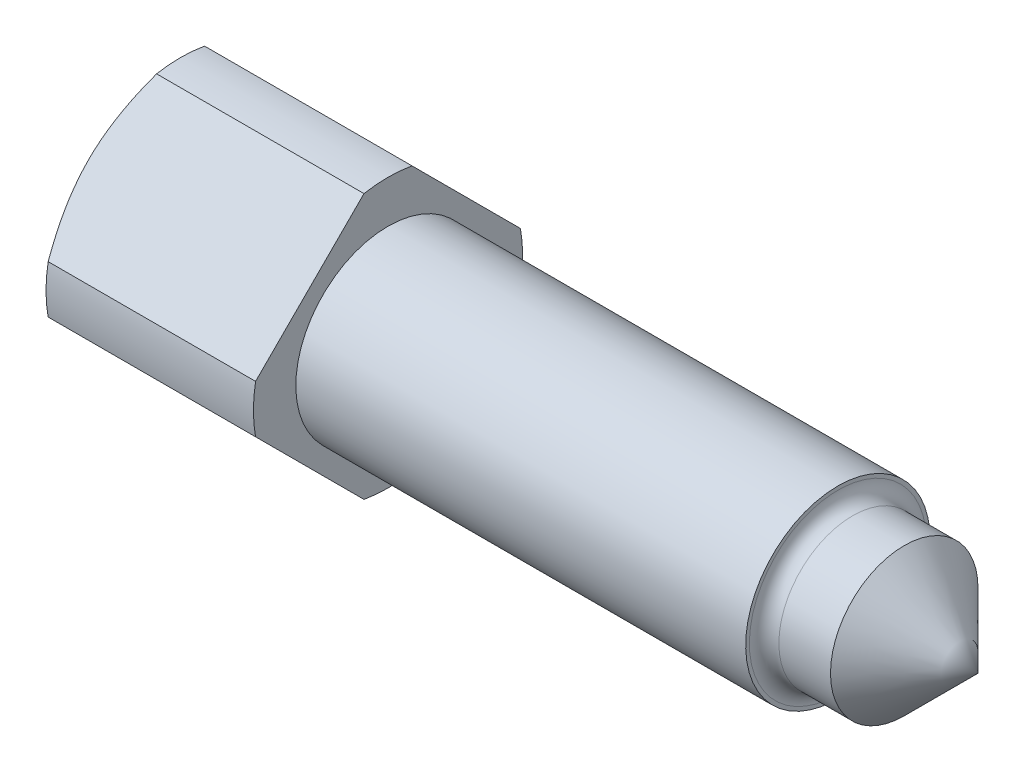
ISO-10303-21;
HEADER;
FILE_DESCRIPTION(('STEP AP214'),'2;1');
FILE_NAME('part.step','',(''),(''),'','','');
FILE_SCHEMA(('AUTOMOTIVE_DESIGN { 1 0 10303 214 1 1 1 1 }'));
ENDSEC;
DATA;
#1=APPLICATION_CONTEXT('core data for automotive mechanical design processes');
#2=APPLICATION_PROTOCOL_DEFINITION('international standard','automotive_design',2000,#1);
#3=PRODUCT_CONTEXT('',#1,'mechanical');
#4=PRODUCT('Part','Part','',(#3));
#5=PRODUCT_RELATED_PRODUCT_CATEGORY('part','',(#4));
#6=PRODUCT_DEFINITION_FORMATION('','',#4);
#7=PRODUCT_DEFINITION_CONTEXT('part definition',#1,'design');
#8=PRODUCT_DEFINITION('design','',#6,#7);
#9=PRODUCT_DEFINITION_SHAPE('','',#8);
#10=(LENGTH_UNIT() NAMED_UNIT(*) SI_UNIT(.MILLI.,.METRE.));
#11=(NAMED_UNIT(*) PLANE_ANGLE_UNIT() SI_UNIT($,.RADIAN.));
#12=(NAMED_UNIT(*) SI_UNIT($,.STERADIAN.) SOLID_ANGLE_UNIT());
#13=UNCERTAINTY_MEASURE_WITH_UNIT(LENGTH_MEASURE(1.E-05),#10,'distance_accuracy_value','');
#14=(GEOMETRIC_REPRESENTATION_CONTEXT(3) GLOBAL_UNCERTAINTY_ASSIGNED_CONTEXT((#13)) GLOBAL_UNIT_ASSIGNED_CONTEXT((#10,
#11,#12)) REPRESENTATION_CONTEXT('',''));
#15=CARTESIAN_POINT('',(0.,0.,0.));
#16=DIRECTION('',(0.,0.,1.));
#17=DIRECTION('',(1.,0.,0.));
#18=AXIS2_PLACEMENT_3D('',#15,#16,#17);
#19=CARTESIAN_POINT('',(6.,0.,0.));
#20=DIRECTION('',(1.,0.,0.));
#21=DIRECTION('',(0.,0.,-1.));
#22=AXIS2_PLACEMENT_3D('',#19,#20,#21);
#23=PLANE('',#22);
#24=CARTESIAN_POINT('',(6.,0.,0.));
#25=DIRECTION('',(1.,0.,0.));
#26=DIRECTION('',(0.,0.,-1.));
#27=AXIS2_PLACEMENT_3D('',#24,#25,#26);
#28=CIRCLE('',#27,3.65);
#29=CARTESIAN_POINT('',(6.00000000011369,0.651201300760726,3.59143938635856));
#30=VERTEX_POINT('',#29);
#31=CARTESIAN_POINT('',(6.00000000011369,-0.651201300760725,3.59143938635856));
#32=VERTEX_POINT('',#31);
#33=EDGE_CURVE('E265',#30,#32,#28,.T.);
#34=ORIENTED_EDGE('',*,*,#33,.T.);
#35=DIRECTION('',(0.,0.707106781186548,0.707106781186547));
#36=VECTOR('',#35,1.);
#37=CARTESIAN_POINT('',(6.00000000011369,-4.24264068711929,0.));
#38=LINE('',#37,#36);
#39=CARTESIAN_POINT('',(6.00000000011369,-3.59143938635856,0.651201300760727));
#40=VERTEX_POINT('',#39);
#41=EDGE_CURVE('E271',#40,#32,#38,.T.);
#42=ORIENTED_EDGE('',*,*,#41,.F.);
#43=CARTESIAN_POINT('',(6.00000000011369,-3.59143938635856,-0.651201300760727));
#44=VERTEX_POINT('',#43);
#45=EDGE_CURVE('E261',#40,#44,#28,.T.);
#46=ORIENTED_EDGE('',*,*,#45,.T.);
#47=DIRECTION('',(0.,-0.707106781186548,0.707106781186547));
#48=VECTOR('',#47,1.);
#49=CARTESIAN_POINT('',(6.00000000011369,0.,-4.24264068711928));
#50=LINE('',#49,#48);
#51=CARTESIAN_POINT('',(6.00000000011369,-0.651201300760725,-3.59143938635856));
#52=VERTEX_POINT('',#51);
#53=EDGE_CURVE('E283',#52,#44,#50,.T.);
#54=ORIENTED_EDGE('',*,*,#53,.F.);
#55=CARTESIAN_POINT('',(6.00000000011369,0.651201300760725,-3.59143938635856));
#56=VERTEX_POINT('',#55);
#57=EDGE_CURVE('E259',#52,#56,#28,.T.);
#58=ORIENTED_EDGE('',*,*,#57,.T.);
#59=DIRECTION('',(0.,-0.707106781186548,-0.707106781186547));
#60=VECTOR('',#59,1.);
#61=CARTESIAN_POINT('',(6.00000000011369,4.24264068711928,0.));
#62=LINE('',#61,#60);
#63=CARTESIAN_POINT('',(6.00000000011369,3.59143938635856,-0.651201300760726));
#64=VERTEX_POINT('',#63);
#65=EDGE_CURVE('E278',#64,#56,#62,.T.);
#66=ORIENTED_EDGE('',*,*,#65,.F.);
#67=CARTESIAN_POINT('',(6.00000000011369,3.59143938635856,0.651201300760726));
#68=VERTEX_POINT('',#67);
#69=EDGE_CURVE('E238',#64,#68,#28,.T.);
#70=ORIENTED_EDGE('',*,*,#69,.T.);
#71=DIRECTION('',(0.,0.707106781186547,-0.707106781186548));
#72=VECTOR('',#71,1.);
#73=CARTESIAN_POINT('',(6.00000000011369,0.,4.24264068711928));
#74=LINE('',#73,#72);
#75=EDGE_CURVE('E273',#30,#68,#74,.T.);
#76=ORIENTED_EDGE('',*,*,#75,.F.);
#77=EDGE_LOOP('',(#34,#42,#46,#54,#58,#66,#70,#76));
#78=FACE_BOUND('',#77,.T.);
#79=CARTESIAN_POINT('',(6.00000000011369,0.,0.));
#80=DIRECTION('',(1.,0.,0.));
#81=DIRECTION('',(0.,1.,0.));
#82=AXIS2_PLACEMENT_3D('',#79,#80,#81);
#83=CIRCLE('',#82,2.5);
#84=CARTESIAN_POINT('',(6.00000000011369,2.5,0.));
#85=VERTEX_POINT('',#84);
#86=EDGE_CURVE('E130',#85,#85,#83,.T.);
#87=ORIENTED_EDGE('',*,*,#86,.F.);
#88=EDGE_LOOP('',(#87));
#89=FACE_BOUND('',#88,.T.);
#90=ADVANCED_FACE('F38',(#78,#89),#23,.T.);
#91=CARTESIAN_POINT('',(6.,0.,0.));
#92=DIRECTION('',(-1.,0.,0.));
#93=DIRECTION('',(0.,0.,1.));
#94=AXIS2_PLACEMENT_3D('',#91,#92,#93);
#95=CYLINDRICAL_SURFACE('',#94,3.65);
#96=DIRECTION('',(-1.,0.,0.));
#97=VECTOR('',#96,1.);
#98=CARTESIAN_POINT('',(6.,0.651201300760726,3.59143938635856));
#99=LINE('',#98,#97);
#100=CARTESIAN_POINT('',(0.375277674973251,0.651201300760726,3.59143938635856));
#101=VERTEX_POINT('',#100);
#102=EDGE_CURVE('E247',#101,#30,#99,.F.);
#103=ORIENTED_EDGE('',*,*,#102,.F.);
#104=CARTESIAN_POINT('',(0.375277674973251,0.,0.));
#105=DIRECTION('',(1.,0.,0.));
#106=DIRECTION('',(0.,1.,0.));
#107=AXIS2_PLACEMENT_3D('',#104,#105,#106);
#108=CIRCLE('',#107,3.65);
#109=CARTESIAN_POINT('',(0.375277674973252,-0.651201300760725,3.59143938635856));
#110=VERTEX_POINT('',#109);
#111=EDGE_CURVE('E142',#101,#110,#108,.T.);
#112=ORIENTED_EDGE('',*,*,#111,.T.);
#113=DIRECTION('',(-1.,0.,0.));
#114=VECTOR('',#113,1.);
#115=CARTESIAN_POINT('',(6.,-0.651201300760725,3.59143938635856));
#116=LINE('',#115,#114);
#117=EDGE_CURVE('E257',#32,#110,#116,.T.);
#118=ORIENTED_EDGE('',*,*,#117,.F.);
#119=ORIENTED_EDGE('',*,*,#33,.F.);
#120=EDGE_LOOP('',(#103,#112,#118,#119));
#121=FACE_BOUND('',#120,.T.);
#122=ADVANCED_FACE('F211',(#121),#95,.T.);
#123=DIRECTION('',(-1.,0.,0.));
#124=VECTOR('',#123,1.);
#125=CARTESIAN_POINT('',(6.,-3.59143938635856,0.651201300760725));
#126=LINE('',#125,#124);
#127=CARTESIAN_POINT('',(0.375277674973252,-3.59143938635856,0.651201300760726));
#128=VERTEX_POINT('',#127);
#129=EDGE_CURVE('E255',#128,#40,#126,.F.);
#130=ORIENTED_EDGE('',*,*,#129,.F.);
#131=CARTESIAN_POINT('',(0.375277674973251,0.,0.));
#132=DIRECTION('',(1.,0.,0.));
#133=DIRECTION('',(0.,1.,0.));
#134=AXIS2_PLACEMENT_3D('',#131,#132,#133);
#135=CIRCLE('',#134,3.65);
#136=CARTESIAN_POINT('',(0.375277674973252,-3.59143938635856,-0.651201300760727));
#137=VERTEX_POINT('',#136);
#138=EDGE_CURVE('E138',#128,#137,#135,.T.);
#139=ORIENTED_EDGE('',*,*,#138,.T.);
#140=DIRECTION('',(-1.,0.,0.));
#141=VECTOR('',#140,1.);
#142=CARTESIAN_POINT('',(6.,-3.59143938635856,-0.651201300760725));
#143=LINE('',#142,#141);
#144=EDGE_CURVE('E252',#44,#137,#143,.T.);
#145=ORIENTED_EDGE('',*,*,#144,.F.);
#146=ORIENTED_EDGE('',*,*,#45,.F.);
#147=EDGE_LOOP('',(#130,#139,#145,#146));
#148=FACE_BOUND('',#147,.T.);
#149=ADVANCED_FACE('F217',(#148),#95,.T.);
#150=DIRECTION('',(-1.,0.,0.));
#151=VECTOR('',#150,1.);
#152=CARTESIAN_POINT('',(6.,-0.651201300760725,-3.59143938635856));
#153=LINE('',#152,#151);
#154=CARTESIAN_POINT('',(0.375277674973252,-0.651201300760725,-3.59143938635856));
#155=VERTEX_POINT('',#154);
#156=EDGE_CURVE('E245',#155,#52,#153,.F.);
#157=ORIENTED_EDGE('',*,*,#156,.F.);
#158=CARTESIAN_POINT('',(0.375277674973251,0.,0.));
#159=DIRECTION('',(1.,0.,0.));
#160=DIRECTION('',(0.,1.,0.));
#161=AXIS2_PLACEMENT_3D('',#158,#159,#160);
#162=CIRCLE('',#161,3.65);
#163=CARTESIAN_POINT('',(0.375277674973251,0.651201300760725,-3.59143938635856));
#164=VERTEX_POINT('',#163);
#165=EDGE_CURVE('E192',#155,#164,#162,.T.);
#166=ORIENTED_EDGE('',*,*,#165,.T.);
#167=DIRECTION('',(-1.,0.,0.));
#168=VECTOR('',#167,1.);
#169=CARTESIAN_POINT('',(6.,0.651201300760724,-3.59143938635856));
#170=LINE('',#169,#168);
#171=EDGE_CURVE('E241',#56,#164,#170,.T.);
#172=ORIENTED_EDGE('',*,*,#171,.F.);
#173=ORIENTED_EDGE('',*,*,#57,.F.);
#174=EDGE_LOOP('',(#157,#166,#172,#173));
#175=FACE_BOUND('',#174,.T.);
#176=ADVANCED_FACE('F222',(#175),#95,.T.);
#177=DIRECTION('',(-1.,0.,0.));
#178=VECTOR('',#177,1.);
#179=CARTESIAN_POINT('',(6.,3.59143938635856,-0.651201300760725));
#180=LINE('',#179,#178);
#181=CARTESIAN_POINT('',(0.375277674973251,3.59143938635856,-0.651201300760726));
#182=VERTEX_POINT('',#181);
#183=EDGE_CURVE('E234',#182,#64,#180,.F.);
#184=ORIENTED_EDGE('',*,*,#183,.F.);
#185=CARTESIAN_POINT('',(0.375277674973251,0.,0.));
#186=DIRECTION('',(1.,0.,0.));
#187=DIRECTION('',(0.,1.,0.));
#188=AXIS2_PLACEMENT_3D('',#185,#186,#187);
#189=CIRCLE('',#188,3.65);
#190=CARTESIAN_POINT('',(0.37527767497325,3.59143938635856,0.651201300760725));
#191=VERTEX_POINT('',#190);
#192=EDGE_CURVE('E193',#182,#191,#189,.T.);
#193=ORIENTED_EDGE('',*,*,#192,.T.);
#194=DIRECTION('',(-1.,0.,0.));
#195=VECTOR('',#194,1.);
#196=CARTESIAN_POINT('',(6.,3.59143938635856,0.651201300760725));
#197=LINE('',#196,#195);
#198=EDGE_CURVE('E242',#68,#191,#197,.T.);
#199=ORIENTED_EDGE('',*,*,#198,.F.);
#200=ORIENTED_EDGE('',*,*,#69,.F.);
#201=EDGE_LOOP('',(#184,#193,#199,#200));
#202=FACE_BOUND('',#201,.T.);
#203=ADVANCED_FACE('F202',(#202),#95,.T.);
#204=CARTESIAN_POINT('',(6.00000000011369,0.,4.24264068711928));
#205=DIRECTION('',(0.,0.707106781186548,0.707106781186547));
#206=DIRECTION('',(0.,-0.707106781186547,0.707106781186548));
#207=AXIS2_PLACEMENT_3D('',#204,#205,#206);
#208=PLANE('',#207);
#209=CARTESIAN_POINT('',(0.375370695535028,0.651001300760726,3.59163938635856));
#210=CARTESIAN_POINT('',(0.323268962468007,0.763120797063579,3.47951989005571));
#211=CARTESIAN_POINT('',(0.274661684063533,0.876174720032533,3.36646596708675));
#212=CARTESIAN_POINT('',(0.18690962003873,1.10452820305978,3.13811248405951));
#213=CARTESIAN_POINT('',(0.14779994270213,1.21983444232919,3.0228062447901));
#214=CARTESIAN_POINT('',(0.0829033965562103,1.44883414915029,2.79380653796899));
#215=CARTESIAN_POINT('',(0.0567585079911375,1.56247530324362,2.68016538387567));
#216=CARTESIAN_POINT('',(0.0185374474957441,1.79078192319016,2.45185876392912));
#217=CARTESIAN_POINT('',(0.00643659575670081,1.90544523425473,2.33719545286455));
#218=CARTESIAN_POINT('',(-0.000588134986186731,2.08579182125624,2.15684886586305));
#219=CARTESIAN_POINT('',(-0.000652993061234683,2.15139124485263,2.09124944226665));
#220=CARTESIAN_POINT('',(0.00417098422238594,2.28250476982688,1.9601359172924));
#221=CARTESIAN_POINT('',(0.00906003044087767,2.34801886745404,1.89462181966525));
#222=CARTESIAN_POINT('',(0.0236362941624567,2.4789109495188,1.76372973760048));
#223=CARTESIAN_POINT('',(0.0333332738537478,2.54428838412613,1.69835230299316));
#224=CARTESIAN_POINT('',(0.0571990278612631,2.67463782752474,1.56800285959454));
#225=CARTESIAN_POINT('',(0.0713685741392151,2.73960976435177,1.50303092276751));
#226=CARTESIAN_POINT('',(0.121061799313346,2.93818256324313,1.30445812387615));
#227=CARTESIAN_POINT('',(0.163229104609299,3.07096692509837,1.17167376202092));
#228=CARTESIAN_POINT('',(0.236253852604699,3.26794686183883,0.974693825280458));
#229=CARTESIAN_POINT('',(0.262163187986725,3.3331132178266,0.909527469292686));
#230=CARTESIAN_POINT('',(0.316779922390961,3.46282259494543,0.77981809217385));
#231=CARTESIAN_POINT('',(0.345485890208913,3.52736591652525,0.715274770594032));
#232=CARTESIAN_POINT('',(0.375370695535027,3.59163938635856,0.651001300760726));
#233=B_SPLINE_CURVE_WITH_KNOTS('',3,(#209,#210,#211,#212,#213,#214,#215,#216,#217,#218,#219,
#220,#221,#222,#223,#224,#225,#226,#227,#228,#229,#230,#231,#232),.UNSPECIFIED.,.F.,.F.,(4,2,2,
2,2,2,2,2,2,2,2,4),(0.,0.50091636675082,1.0036571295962,1.49161120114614,1.97870647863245,
2.25690162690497,2.53510861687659,2.81388281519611,3.09270515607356,3.66932423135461,
3.95649300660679,4.24351558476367),.UNSPECIFIED.);
#234=CARTESIAN_POINT('',(0.,2.12132034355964,2.12132034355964));
#235=VERTEX_POINT('',#234);
#236=EDGE_CURVE('E154',#101,#235,#233,.T.);
#237=ORIENTED_EDGE('',*,*,#236,.F.);
#238=ORIENTED_EDGE('',*,*,#102,.T.);
#239=ORIENTED_EDGE('',*,*,#75,.T.);
#240=ORIENTED_EDGE('',*,*,#198,.T.);
#241=EDGE_CURVE('E280',#235,#191,#233,.T.);
#242=ORIENTED_EDGE('',*,*,#241,.F.);
#243=EDGE_LOOP('',(#237,#238,#239,#240,#242));
#244=FACE_BOUND('',#243,.T.);
#245=ADVANCED_FACE('F198',(#244),#208,.T.);
#246=CARTESIAN_POINT('',(6.00000000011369,4.24264068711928,0.));
#247=DIRECTION('',(0.,0.707106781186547,-0.707106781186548));
#248=DIRECTION('',(0.,0.707106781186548,0.707106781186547));
#249=AXIS2_PLACEMENT_3D('',#246,#247,#248);
#250=PLANE('',#249);
#251=CARTESIAN_POINT('',(0.375370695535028,3.59163938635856,-0.651001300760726));
#252=CARTESIAN_POINT('',(0.323268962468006,3.47951989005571,-0.763120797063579));
#253=CARTESIAN_POINT('',(0.274661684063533,3.36646596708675,-0.876174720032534));
#254=CARTESIAN_POINT('',(0.18690962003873,3.13811248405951,-1.10452820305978));
#255=CARTESIAN_POINT('',(0.14779994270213,3.0228062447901,-1.21983444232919));
#256=CARTESIAN_POINT('',(0.0829033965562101,2.79380653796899,-1.44883414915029));
#257=CARTESIAN_POINT('',(0.0567585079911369,2.68016538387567,-1.56247530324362));
#258=CARTESIAN_POINT('',(0.0185374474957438,2.45185876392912,-1.79078192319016));
#259=CARTESIAN_POINT('',(0.00643659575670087,2.33719545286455,-1.90544523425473));
#260=CARTESIAN_POINT('',(-0.000588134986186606,2.15684886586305,-2.08579182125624));
#261=CARTESIAN_POINT('',(-0.000652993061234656,2.09124944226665,-2.15139124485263));
#262=CARTESIAN_POINT('',(0.00417098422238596,1.9601359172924,-2.28250476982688));
#263=CARTESIAN_POINT('',(0.00906003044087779,1.89462181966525,-2.34801886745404));
#264=CARTESIAN_POINT('',(0.023636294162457,1.76372973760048,-2.4789109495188));
#265=CARTESIAN_POINT('',(0.0333332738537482,1.69835230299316,-2.54428838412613));
#266=CARTESIAN_POINT('',(0.0571990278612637,1.56800285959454,-2.67463782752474));
#267=CARTESIAN_POINT('',(0.0713685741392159,1.50303092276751,-2.73960976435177));
#268=CARTESIAN_POINT('',(0.121061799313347,1.30445812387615,-2.93818256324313));
#269=CARTESIAN_POINT('',(0.1632291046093,1.17167376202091,-3.07096692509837));
#270=CARTESIAN_POINT('',(0.2362538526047,0.974693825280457,-3.26794686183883));
#271=CARTESIAN_POINT('',(0.262163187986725,0.909527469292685,-3.3331132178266));
#272=CARTESIAN_POINT('',(0.316779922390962,0.779818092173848,-3.46282259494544));
#273=CARTESIAN_POINT('',(0.345485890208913,0.715274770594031,-3.52736591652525));
#274=CARTESIAN_POINT('',(0.375370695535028,0.651001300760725,-3.59163938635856));
#275=B_SPLINE_CURVE_WITH_KNOTS('',3,(#251,#252,#253,#254,#255,#256,#257,#258,#259,#260,#261,
#262,#263,#264,#265,#266,#267,#268,#269,#270,#271,#272,#273,#274),.UNSPECIFIED.,.F.,.F.,(4,2,2,
2,2,2,2,2,2,2,2,4),(0.,0.500916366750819,1.0036571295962,1.49161120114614,1.97870647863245,
2.25690162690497,2.53510861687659,2.81388281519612,3.09270515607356,3.66932423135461,
3.95649300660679,4.24351558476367),.UNSPECIFIED.);
#276=CARTESIAN_POINT('',(0.,2.12132034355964,-2.12132034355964));
#277=VERTEX_POINT('',#276);
#278=EDGE_CURVE('E191',#182,#277,#275,.T.);
#279=ORIENTED_EDGE('',*,*,#278,.F.);
#280=ORIENTED_EDGE('',*,*,#183,.T.);
#281=ORIENTED_EDGE('',*,*,#65,.T.);
#282=ORIENTED_EDGE('',*,*,#171,.T.);
#283=EDGE_CURVE('E185',#277,#164,#275,.T.);
#284=ORIENTED_EDGE('',*,*,#283,.F.);
#285=EDGE_LOOP('',(#279,#280,#281,#282,#284));
#286=FACE_BOUND('',#285,.T.);
#287=ADVANCED_FACE('F195',(#286),#250,.T.);
#288=CARTESIAN_POINT('',(6.00000000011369,0.,-4.24264068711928));
#289=DIRECTION('',(0.,-0.707106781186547,-0.707106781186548));
#290=DIRECTION('',(0.,0.707106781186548,-0.707106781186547));
#291=AXIS2_PLACEMENT_3D('',#288,#289,#290);
#292=PLANE('',#291);
#293=CARTESIAN_POINT('',(0.375370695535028,-0.651001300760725,-3.59163938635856));
#294=CARTESIAN_POINT('',(0.323268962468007,-0.763120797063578,-3.47951989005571));
#295=CARTESIAN_POINT('',(0.274661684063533,-0.876174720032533,-3.36646596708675));
#296=CARTESIAN_POINT('',(0.18690962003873,-1.10452820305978,-3.13811248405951));
#297=CARTESIAN_POINT('',(0.14779994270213,-1.21983444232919,-3.0228062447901));
#298=CARTESIAN_POINT('',(0.0829033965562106,-1.44883414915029,-2.79380653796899));
#299=CARTESIAN_POINT('',(0.0567585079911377,-1.56247530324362,-2.68016538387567));
#300=CARTESIAN_POINT('',(0.0185374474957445,-1.79078192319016,-2.45185876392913));
#301=CARTESIAN_POINT('',(0.0064365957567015,-1.90544523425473,-2.33719545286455));
#302=CARTESIAN_POINT('',(-0.000588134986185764,-2.08579182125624,-2.15684886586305));
#303=CARTESIAN_POINT('',(-0.000652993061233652,-2.15139124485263,-2.09124944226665));
#304=CARTESIAN_POINT('',(0.00417098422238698,-2.28250476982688,-1.9601359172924));
#305=CARTESIAN_POINT('',(0.00906003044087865,-2.34801886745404,-1.89462181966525));
#306=CARTESIAN_POINT('',(0.0236362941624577,-2.4789109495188,-1.76372973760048));
#307=CARTESIAN_POINT('',(0.0333332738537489,-2.54428838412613,-1.69835230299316));
#308=CARTESIAN_POINT('',(0.0571990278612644,-2.67463782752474,-1.56800285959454));
#309=CARTESIAN_POINT('',(0.0713685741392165,-2.73960976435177,-1.50303092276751));
#310=CARTESIAN_POINT('',(0.121061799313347,-2.93818256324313,-1.30445812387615));
#311=CARTESIAN_POINT('',(0.163229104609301,-3.07096692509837,-1.17167376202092));
#312=CARTESIAN_POINT('',(0.2362538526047,-3.26794686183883,-0.974693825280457));
#313=CARTESIAN_POINT('',(0.262163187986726,-3.3331132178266,-0.909527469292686));
#314=CARTESIAN_POINT('',(0.316779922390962,-3.46282259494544,-0.779818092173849));
#315=CARTESIAN_POINT('',(0.345485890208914,-3.52736591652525,-0.715274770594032));
#316=CARTESIAN_POINT('',(0.375370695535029,-3.59163938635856,-0.651001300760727));
#317=B_SPLINE_CURVE_WITH_KNOTS('',3,(#293,#294,#295,#296,#297,#298,#299,#300,#301,#302,#303,
#304,#305,#306,#307,#308,#309,#310,#311,#312,#313,#314,#315,#316),.UNSPECIFIED.,.F.,.F.,(4,2,2,
2,2,2,2,2,2,2,2,4),(0.,0.500916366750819,1.0036571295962,1.49161120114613,1.97870647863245,
2.25690162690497,2.53510861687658,2.81388281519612,3.09270515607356,3.66932423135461,
3.95649300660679,4.24351558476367),.UNSPECIFIED.);
#318=CARTESIAN_POINT('',(0.,-2.12132034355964,-2.12132034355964));
#319=VERTEX_POINT('',#318);
#320=EDGE_CURVE('E153',#155,#319,#317,.T.);
#321=ORIENTED_EDGE('',*,*,#320,.F.);
#322=ORIENTED_EDGE('',*,*,#156,.T.);
#323=ORIENTED_EDGE('',*,*,#53,.T.);
#324=ORIENTED_EDGE('',*,*,#144,.T.);
#325=EDGE_CURVE('E145',#319,#137,#317,.T.);
#326=ORIENTED_EDGE('',*,*,#325,.F.);
#327=EDGE_LOOP('',(#321,#322,#323,#324,#326));
#328=FACE_BOUND('',#327,.T.);
#329=ADVANCED_FACE('F161',(#328),#292,.T.);
#330=CARTESIAN_POINT('',(6.00000000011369,-4.24264068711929,0.));
#331=DIRECTION('',(0.,-0.707106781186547,0.707106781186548));
#332=DIRECTION('',(0.,-0.707106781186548,-0.707106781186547));
#333=AXIS2_PLACEMENT_3D('',#330,#331,#332);
#334=PLANE('',#333);
#335=CARTESIAN_POINT('',(0.375370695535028,-3.59163938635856,0.651001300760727));
#336=CARTESIAN_POINT('',(0.323268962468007,-3.47951989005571,0.76312079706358));
#337=CARTESIAN_POINT('',(0.274661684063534,-3.36646596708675,0.876174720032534));
#338=CARTESIAN_POINT('',(0.18690962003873,-3.13811248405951,1.10452820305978));
#339=CARTESIAN_POINT('',(0.14779994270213,-3.0228062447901,1.21983444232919));
#340=CARTESIAN_POINT('',(0.0829033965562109,-2.79380653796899,1.44883414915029));
#341=CARTESIAN_POINT('',(0.0567585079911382,-2.68016538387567,1.56247530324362));
#342=CARTESIAN_POINT('',(0.0185374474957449,-2.45185876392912,1.79078192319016));
#343=CARTESIAN_POINT('',(0.00643659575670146,-2.33719545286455,1.90544523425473));
#344=CARTESIAN_POINT('',(-0.000588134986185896,-2.15684886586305,2.08579182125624));
#345=CARTESIAN_POINT('',(-0.000652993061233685,-2.09124944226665,2.15139124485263));
#346=CARTESIAN_POINT('',(0.00417098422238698,-1.9601359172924,2.28250476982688));
#347=CARTESIAN_POINT('',(0.00906003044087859,-1.89462181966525,2.34801886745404));
#348=CARTESIAN_POINT('',(0.0236362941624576,-1.76372973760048,2.4789109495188));
#349=CARTESIAN_POINT('',(0.0333332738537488,-1.69835230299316,2.54428838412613));
#350=CARTESIAN_POINT('',(0.0571990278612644,-1.56800285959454,2.67463782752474));
#351=CARTESIAN_POINT('',(0.0713685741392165,-1.50303092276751,2.73960976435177));
#352=CARTESIAN_POINT('',(0.121061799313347,-1.30445812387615,2.93818256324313));
#353=CARTESIAN_POINT('',(0.163229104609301,-1.17167376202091,3.07096692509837));
#354=CARTESIAN_POINT('',(0.2362538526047,-0.974693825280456,3.26794686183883));
#355=CARTESIAN_POINT('',(0.262163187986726,-0.909527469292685,3.3331132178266));
#356=CARTESIAN_POINT('',(0.316779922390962,-0.779818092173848,3.46282259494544));
#357=CARTESIAN_POINT('',(0.345485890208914,-0.71527477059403,3.52736591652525));
#358=CARTESIAN_POINT('',(0.375370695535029,-0.651001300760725,3.59163938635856));
#359=B_SPLINE_CURVE_WITH_KNOTS('',3,(#335,#336,#337,#338,#339,#340,#341,#342,#343,#344,#345,
#346,#347,#348,#349,#350,#351,#352,#353,#354,#355,#356,#357,#358),.UNSPECIFIED.,.F.,.F.,(4,2,2,
2,2,2,2,2,2,2,2,4),(0.,0.500916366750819,1.0036571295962,1.49161120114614,1.97870647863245,
2.25690162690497,2.53510861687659,2.81388281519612,3.09270515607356,3.66932423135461,
3.95649300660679,4.24351558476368),.UNSPECIFIED.);
#360=CARTESIAN_POINT('',(0.,-2.12132034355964,2.12132034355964));
#361=VERTEX_POINT('',#360);
#362=EDGE_CURVE('E61',#128,#361,#359,.T.);
#363=ORIENTED_EDGE('',*,*,#362,.F.);
#364=ORIENTED_EDGE('',*,*,#129,.T.);
#365=ORIENTED_EDGE('',*,*,#41,.T.);
#366=ORIENTED_EDGE('',*,*,#117,.T.);
#367=EDGE_CURVE('E176',#361,#110,#359,.T.);
#368=ORIENTED_EDGE('',*,*,#367,.F.);
#369=EDGE_LOOP('',(#363,#364,#365,#366,#368));
#370=FACE_BOUND('',#369,.T.);
#371=ADVANCED_FACE('F204',(#370),#334,.T.);
#372=CARTESIAN_POINT('',(0.,0.,0.));
#373=DIRECTION('',(1.,0.,0.));
#374=DIRECTION('',(0.,1.,0.));
#375=AXIS2_PLACEMENT_3D('',#372,#373,#374);
#376=CONICAL_SURFACE('',#375,3.,1.0471975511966);
#377=ORIENTED_EDGE('',*,*,#236,.T.);
#378=CARTESIAN_POINT('',(0.,0.,0.));
#379=DIRECTION('',(1.,0.,0.));
#380=DIRECTION('',(0.,1.,0.));
#381=AXIS2_PLACEMENT_3D('',#378,#379,#380);
#382=CIRCLE('',#381,3.);
#383=EDGE_CURVE('E136',#235,#361,#382,.T.);
#384=ORIENTED_EDGE('',*,*,#383,.T.);
#385=ORIENTED_EDGE('',*,*,#367,.T.);
#386=ORIENTED_EDGE('',*,*,#111,.F.);
#387=EDGE_LOOP('',(#377,#384,#385,#386));
#388=FACE_BOUND('',#387,.T.);
#389=ADVANCED_FACE('F169',(#388),#376,.T.);
#390=ORIENTED_EDGE('',*,*,#325,.T.);
#391=ORIENTED_EDGE('',*,*,#138,.F.);
#392=ORIENTED_EDGE('',*,*,#362,.T.);
#393=EDGE_CURVE('E139',#361,#319,#382,.T.);
#394=ORIENTED_EDGE('',*,*,#393,.T.);
#395=EDGE_LOOP('',(#390,#391,#392,#394));
#396=FACE_BOUND('',#395,.T.);
#397=ADVANCED_FACE('F164',(#396),#376,.T.);
#398=ORIENTED_EDGE('',*,*,#283,.T.);
#399=ORIENTED_EDGE('',*,*,#165,.F.);
#400=ORIENTED_EDGE('',*,*,#320,.T.);
#401=EDGE_CURVE('E53',#319,#277,#382,.T.);
#402=ORIENTED_EDGE('',*,*,#401,.T.);
#403=EDGE_LOOP('',(#398,#399,#400,#402));
#404=FACE_BOUND('',#403,.T.);
#405=ADVANCED_FACE('F168',(#404),#376,.T.);
#406=ORIENTED_EDGE('',*,*,#278,.T.);
#407=EDGE_CURVE('E135',#277,#235,#382,.T.);
#408=ORIENTED_EDGE('',*,*,#407,.T.);
#409=ORIENTED_EDGE('',*,*,#241,.T.);
#410=ORIENTED_EDGE('',*,*,#192,.F.);
#411=EDGE_LOOP('',(#406,#408,#409,#410));
#412=FACE_BOUND('',#411,.T.);
#413=ADVANCED_FACE('F170',(#412),#376,.T.);
#414=CARTESIAN_POINT('',(0.,0.,0.));
#415=DIRECTION('',(1.,0.,0.));
#416=DIRECTION('',(0.,0.,-1.));
#417=AXIS2_PLACEMENT_3D('',#414,#415,#416);
#418=PLANE('',#417);
#419=ORIENTED_EDGE('',*,*,#401,.F.);
#420=ORIENTED_EDGE('',*,*,#393,.F.);
#421=ORIENTED_EDGE('',*,*,#383,.F.);
#422=ORIENTED_EDGE('',*,*,#407,.F.);
#423=EDGE_LOOP('',(#419,#420,#421,#422));
#424=FACE_BOUND('',#423,.T.);
#425=ADVANCED_FACE('F213',(#424),#418,.F.);
#426=CARTESIAN_POINT('',(14.0868030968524,0.,0.));
#427=DIRECTION('',(1.,0.,0.));
#428=DIRECTION('',(0.,1.,0.));
#429=AXIS2_PLACEMENT_3D('',#426,#427,#428);
#430=CYLINDRICAL_SURFACE('',#429,2.5);
#431=CARTESIAN_POINT('',(18.2000000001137,0.,0.));
#432=DIRECTION('',(1.,0.,0.));
#433=DIRECTION('',(0.,1.,0.));
#434=AXIS2_PLACEMENT_3D('',#431,#432,#433);
#435=CIRCLE('',#434,2.5);
#436=CARTESIAN_POINT('',(18.2000000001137,2.50000000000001,0.));
#437=VERTEX_POINT('',#436);
#438=EDGE_CURVE('E127',#437,#437,#435,.T.);
#439=ORIENTED_EDGE('',*,*,#438,.F.);
#440=EDGE_LOOP('',(#439));
#441=FACE_BOUND('',#440,.T.);
#442=ORIENTED_EDGE('',*,*,#86,.T.);
#443=EDGE_LOOP('',(#442));
#444=FACE_BOUND('',#443,.T.);
#445=ADVANCED_FACE('F171',(#441,#444),#430,.T.);
#446=CARTESIAN_POINT('',(18.2000000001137,-2.5,0.));
#447=DIRECTION('',(-1.,0.,0.));
#448=DIRECTION('',(0.,-1.,0.));
#449=AXIS2_PLACEMENT_3D('',#446,#447,#448);
#450=PLANE('',#449);
#451=CARTESIAN_POINT('',(18.2000000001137,0.,0.));
#452=DIRECTION('',(-1.,0.,0.));
#453=DIRECTION('',(0.,-1.,0.));
#454=AXIS2_PLACEMENT_3D('',#451,#452,#453);
#455=CIRCLE('',#454,2.4);
#456=CARTESIAN_POINT('',(18.2000000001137,-2.4,0.));
#457=VERTEX_POINT('',#456);
#458=EDGE_CURVE('E12',#457,#457,#455,.T.);
#459=ORIENTED_EDGE('',*,*,#458,.T.);
#460=EDGE_LOOP('',(#459));
#461=FACE_BOUND('',#460,.T.);
#462=ORIENTED_EDGE('',*,*,#438,.T.);
#463=EDGE_LOOP('',(#462));
#464=FACE_BOUND('',#463,.T.);
#465=ADVANCED_FACE('F346',(#461,#464),#450,.F.);
#466=CARTESIAN_POINT('',(14.0868030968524,0.,0.));
#467=DIRECTION('',(1.,0.,0.));
#468=DIRECTION('',(0.,1.,0.));
#469=AXIS2_PLACEMENT_3D('',#466,#467,#468);
#470=CYLINDRICAL_SURFACE('',#469,2.);
#471=CARTESIAN_POINT('',(18.6000000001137,0.,0.));
#472=DIRECTION('',(-1.,0.,0.));
#473=DIRECTION('',(0.,-1.,0.));
#474=AXIS2_PLACEMENT_3D('',#471,#472,#473);
#475=CIRCLE('',#474,2.);
#476=CARTESIAN_POINT('',(18.6000000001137,-2.,0.));
#477=VERTEX_POINT('',#476);
#478=EDGE_CURVE('E46',#477,#477,#475,.F.);
#479=ORIENTED_EDGE('',*,*,#478,.T.);
#480=EDGE_LOOP('',(#479));
#481=FACE_BOUND('',#480,.T.);
#482=CARTESIAN_POINT('',(20.0000000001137,0.,0.));
#483=DIRECTION('',(1.,0.,0.));
#484=DIRECTION('',(0.,1.,0.));
#485=AXIS2_PLACEMENT_3D('',#482,#483,#484);
#486=CIRCLE('',#485,2.);
#487=CARTESIAN_POINT('',(20.0000000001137,2.00000000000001,0.));
#488=VERTEX_POINT('',#487);
#489=EDGE_CURVE('E125',#488,#488,#486,.T.);
#490=ORIENTED_EDGE('',*,*,#489,.F.);
#491=EDGE_LOOP('',(#490));
#492=FACE_BOUND('',#491,.T.);
#493=ADVANCED_FACE('F121',(#481,#492),#470,.T.);
#494=CARTESIAN_POINT('',(20.0000000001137,0.,0.));
#495=DIRECTION('',(-1.,0.,0.));
#496=DIRECTION('',(0.,-1.,0.));
#497=AXIS2_PLACEMENT_3D('',#494,#495,#496);
#498=CONICAL_SURFACE('',#497,2.,0.78539816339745);
#499=CARTESIAN_POINT('',(22.0000000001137,0.,0.));
#500=VERTEX_POINT('',#499);
#501=VERTEX_LOOP('',#500);
#502=FACE_BOUND('',#501,.T.);
#503=ORIENTED_EDGE('',*,*,#489,.T.);
#504=EDGE_LOOP('',(#503));
#505=FACE_BOUND('',#504,.T.);
#506=ADVANCED_FACE('F118',(#502,#505),#498,.T.);
#507=CARTESIAN_POINT('',(18.6000000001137,0.,0.));
#508=DIRECTION('',(-1.,0.,0.));
#509=DIRECTION('',(0.,-1.,0.));
#510=AXIS2_PLACEMENT_3D('',#507,#508,#509);
#511=TOROIDAL_SURFACE('',#510,2.4,0.4);
#512=ORIENTED_EDGE('',*,*,#458,.F.);
#513=EDGE_LOOP('',(#512));
#514=FACE_BOUND('',#513,.T.);
#515=ORIENTED_EDGE('',*,*,#478,.F.);
#516=EDGE_LOOP('',(#515));
#517=FACE_BOUND('',#516,.T.);
#518=ADVANCED_FACE('F40',(#514,#517),#511,.F.);
#519=CLOSED_SHELL('',(#90,#122,#149,#176,#203,#245,#287,#329,#371,#389,#397,#405,#413,#425,#445,
#465,#493,#506,#518));
#520=MANIFOLD_SOLID_BREP('B2',#519);
#521=ADVANCED_BREP_SHAPE_REPRESENTATION('',(#18,#520),#14);
#522=SHAPE_DEFINITION_REPRESENTATION(#9,#521);
ENDSEC;
END-ISO-10303-21;
